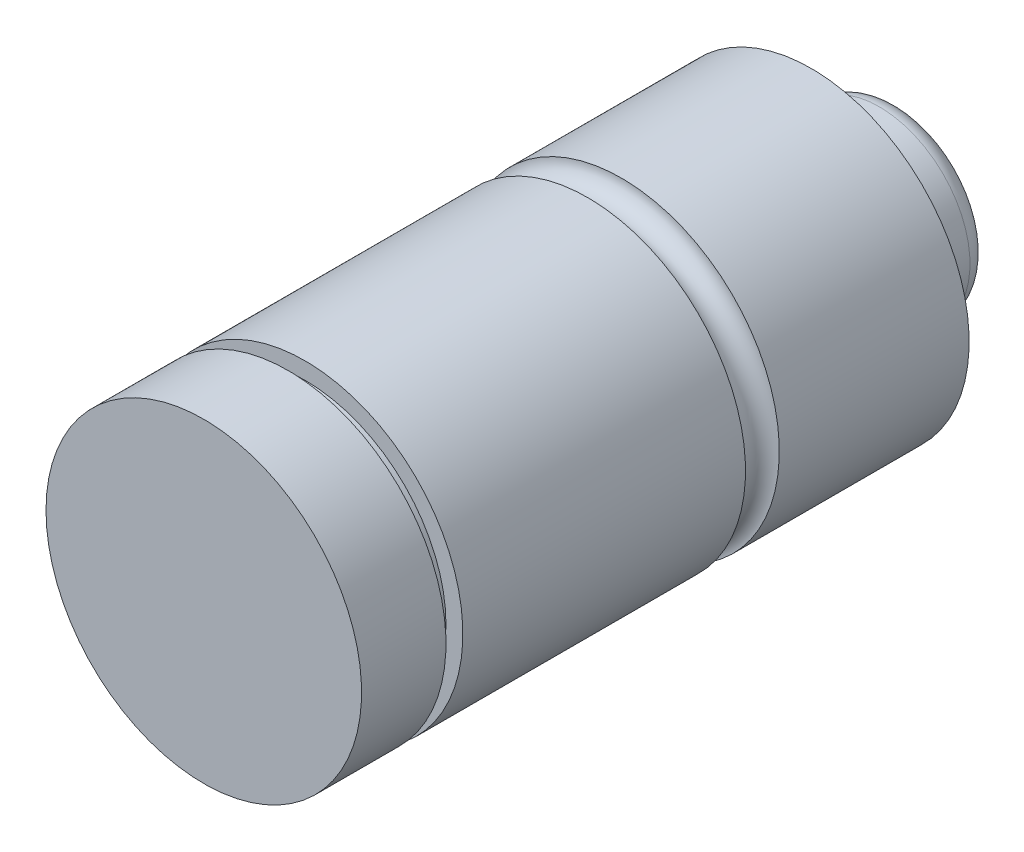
ISO-10303-21;
HEADER;
FILE_DESCRIPTION(('STEP AP214'),'2;1');
FILE_NAME('part.step','',(''),(''),'','','');
FILE_SCHEMA(('AUTOMOTIVE_DESIGN { 1 0 10303 214 1 1 1 1 }'));
ENDSEC;
DATA;
#1=APPLICATION_CONTEXT('core data for automotive mechanical design processes');
#2=APPLICATION_PROTOCOL_DEFINITION('international standard','automotive_design',2000,#1);
#3=PRODUCT_CONTEXT('',#1,'mechanical');
#4=PRODUCT('Part','Part','',(#3));
#5=PRODUCT_RELATED_PRODUCT_CATEGORY('part','',(#4));
#6=PRODUCT_DEFINITION_FORMATION('','',#4);
#7=PRODUCT_DEFINITION_CONTEXT('part definition',#1,'design');
#8=PRODUCT_DEFINITION('design','',#6,#7);
#9=PRODUCT_DEFINITION_SHAPE('','',#8);
#10=(LENGTH_UNIT() NAMED_UNIT(*) SI_UNIT(.MILLI.,.METRE.));
#11=(NAMED_UNIT(*) PLANE_ANGLE_UNIT() SI_UNIT($,.RADIAN.));
#12=(NAMED_UNIT(*) SI_UNIT($,.STERADIAN.) SOLID_ANGLE_UNIT());
#13=UNCERTAINTY_MEASURE_WITH_UNIT(LENGTH_MEASURE(1.E-05),#10,'distance_accuracy_value','');
#14=(GEOMETRIC_REPRESENTATION_CONTEXT(3) GLOBAL_UNCERTAINTY_ASSIGNED_CONTEXT((#13)) GLOBAL_UNIT_ASSIGNED_CONTEXT((#10,
#11,#12)) REPRESENTATION_CONTEXT('',''));
#15=CARTESIAN_POINT('',(0.,0.,0.));
#16=DIRECTION('',(0.,0.,1.));
#17=DIRECTION('',(1.,0.,0.));
#18=AXIS2_PLACEMENT_3D('',#15,#16,#17);
#19=CARTESIAN_POINT('',(0.,0.,-88.0737961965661));
#20=DIRECTION('',(0.,0.,-1.));
#21=DIRECTION('',(-1.,0.,0.));
#22=AXIS2_PLACEMENT_3D('',#19,#20,#21);
#23=CYLINDRICAL_SURFACE('',#22,5.461);
#24=CARTESIAN_POINT('',(0.,0.,-40.6652000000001));
#25=DIRECTION('',(0.,0.,-1.));
#26=DIRECTION('',(-1.,0.,0.));
#27=AXIS2_PLACEMENT_3D('',#24,#25,#26);
#28=CIRCLE('',#27,5.461);
#29=CARTESIAN_POINT('',(-5.461,0.,-40.6652000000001));
#30=VERTEX_POINT('',#29);
#31=EDGE_CURVE('E10',#30,#30,#28,.T.);
#32=ORIENTED_EDGE('',*,*,#31,.F.);
#33=EDGE_LOOP('',(#32));
#34=FACE_BOUND('',#33,.T.);
#35=CARTESIAN_POINT('',(0.,0.,-36.5760000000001));
#36=DIRECTION('',(0.,0.,-1.));
#37=DIRECTION('',(-1.,0.,0.));
#38=AXIS2_PLACEMENT_3D('',#35,#36,#37);
#39=CIRCLE('',#38,5.461);
#40=CARTESIAN_POINT('',(-5.461,0.,-36.5760000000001));
#41=VERTEX_POINT('',#40);
#42=EDGE_CURVE('E94',#41,#41,#39,.T.);
#43=ORIENTED_EDGE('',*,*,#42,.T.);
#44=EDGE_LOOP('',(#43));
#45=FACE_BOUND('',#44,.T.);
#46=ADVANCED_FACE('F45',(#34,#45),#23,.T.);
#47=CARTESIAN_POINT('',(0.,0.,-40.6652000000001));
#48=DIRECTION('',(0.,0.,-1.));
#49=DIRECTION('',(-1.,0.,0.));
#50=AXIS2_PLACEMENT_3D('',#47,#48,#49);
#51=TOROIDAL_SURFACE('',#50,4.2672,1.1938);
#52=CARTESIAN_POINT('',(0.,0.,-41.8590000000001));
#53=DIRECTION('',(0.,0.,-1.));
#54=DIRECTION('',(-1.,0.,0.));
#55=AXIS2_PLACEMENT_3D('',#52,#53,#54);
#56=CIRCLE('',#55,4.2672);
#57=CARTESIAN_POINT('',(-4.2672,0.,-41.8590000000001));
#58=VERTEX_POINT('',#57);
#59=EDGE_CURVE('E52',#58,#58,#56,.T.);
#60=ORIENTED_EDGE('',*,*,#59,.F.);
#61=EDGE_LOOP('',(#60));
#62=FACE_BOUND('',#61,.T.);
#63=ORIENTED_EDGE('',*,*,#31,.T.);
#64=EDGE_LOOP('',(#63));
#65=FACE_BOUND('',#64,.T.);
#66=ADVANCED_FACE('F156',(#62,#65),#51,.T.);
#67=CARTESIAN_POINT('',(-4.26720000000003,0.,-41.8590000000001));
#68=DIRECTION('',(0.,0.,1.));
#69=DIRECTION('',(1.,0.,0.));
#70=AXIS2_PLACEMENT_3D('',#67,#68,#69);
#71=PLANE('',#70);
#72=ORIENTED_EDGE('',*,*,#59,.T.);
#73=EDGE_LOOP('',(#72));
#74=FACE_BOUND('',#73,.T.);
#75=ADVANCED_FACE('F151',(#74),#71,.F.);
#76=CARTESIAN_POINT('',(0.,0.,0.));
#77=DIRECTION('',(0.,0.,-1.));
#78=DIRECTION('',(-1.,0.,0.));
#79=AXIS2_PLACEMENT_3D('',#76,#77,#78);
#80=PLANE('',#79);
#81=CARTESIAN_POINT('',(0.,0.,0.));
#82=DIRECTION('',(0.,0.,-1.));
#83=DIRECTION('',(-1.,0.,0.));
#84=AXIS2_PLACEMENT_3D('',#81,#82,#83);
#85=CIRCLE('',#84,9.4996);
#86=CARTESIAN_POINT('',(-9.4996,0.,0.));
#87=VERTEX_POINT('',#86);
#88=EDGE_CURVE('E58',#87,#87,#85,.T.);
#89=ORIENTED_EDGE('',*,*,#88,.F.);
#90=EDGE_LOOP('',(#89));
#91=FACE_BOUND('',#90,.T.);
#92=ADVANCED_FACE('F146',(#91),#80,.F.);
#93=CARTESIAN_POINT('',(0.,0.,-88.0737961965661));
#94=DIRECTION('',(0.,0.,-1.));
#95=DIRECTION('',(-1.,0.,0.));
#96=AXIS2_PLACEMENT_3D('',#93,#94,#95);
#97=CYLINDRICAL_SURFACE('',#96,9.4996);
#98=CARTESIAN_POINT('',(0.,0.,-5.08));
#99=DIRECTION('',(0.,0.,-1.));
#100=DIRECTION('',(-1.,0.,0.));
#101=AXIS2_PLACEMENT_3D('',#98,#99,#100);
#102=CIRCLE('',#101,9.4996);
#103=CARTESIAN_POINT('',(-9.4996,0.,-5.08));
#104=VERTEX_POINT('',#103);
#105=EDGE_CURVE('E64',#104,#104,#102,.T.);
#106=ORIENTED_EDGE('',*,*,#105,.F.);
#107=EDGE_LOOP('',(#106));
#108=FACE_BOUND('',#107,.T.);
#109=ORIENTED_EDGE('',*,*,#88,.T.);
#110=EDGE_LOOP('',(#109));
#111=FACE_BOUND('',#110,.T.);
#112=ADVANCED_FACE('F140',(#108,#111),#97,.T.);
#113=CARTESIAN_POINT('',(-9.49960000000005,0.,-5.08));
#114=DIRECTION('',(0.,0.,1.));
#115=DIRECTION('',(1.,0.,0.));
#116=AXIS2_PLACEMENT_3D('',#113,#114,#115);
#117=PLANE('',#116);
#118=CARTESIAN_POINT('',(0.,0.,-5.08));
#119=DIRECTION('',(0.,0.,-1.));
#120=DIRECTION('',(-1.,0.,0.));
#121=AXIS2_PLACEMENT_3D('',#118,#119,#120);
#122=CIRCLE('',#121,8.4836);
#123=CARTESIAN_POINT('',(-8.4836,0.,-5.08));
#124=VERTEX_POINT('',#123);
#125=EDGE_CURVE('E70',#124,#124,#122,.T.);
#126=ORIENTED_EDGE('',*,*,#125,.F.);
#127=EDGE_LOOP('',(#126));
#128=FACE_BOUND('',#127,.T.);
#129=ORIENTED_EDGE('',*,*,#105,.T.);
#130=EDGE_LOOP('',(#129));
#131=FACE_BOUND('',#130,.T.);
#132=ADVANCED_FACE('F134',(#128,#131),#117,.F.);
#133=CARTESIAN_POINT('',(0.,0.,-88.0737961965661));
#134=DIRECTION('',(0.,0.,-1.));
#135=DIRECTION('',(-1.,0.,0.));
#136=AXIS2_PLACEMENT_3D('',#133,#134,#135);
#137=CYLINDRICAL_SURFACE('',#136,8.4836);
#138=CARTESIAN_POINT('',(0.,0.,-6.096));
#139=DIRECTION('',(0.,0.,-1.));
#140=DIRECTION('',(-1.,0.,0.));
#141=AXIS2_PLACEMENT_3D('',#138,#139,#140);
#142=CIRCLE('',#141,8.4836);
#143=CARTESIAN_POINT('',(-8.4836,0.,-6.09600000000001));
#144=VERTEX_POINT('',#143);
#145=EDGE_CURVE('E74',#144,#144,#142,.T.);
#146=ORIENTED_EDGE('',*,*,#145,.F.);
#147=EDGE_LOOP('',(#146));
#148=FACE_BOUND('',#147,.T.);
#149=ORIENTED_EDGE('',*,*,#125,.T.);
#150=EDGE_LOOP('',(#149));
#151=FACE_BOUND('',#150,.T.);
#152=ADVANCED_FACE('F128',(#148,#151),#137,.T.);
#153=CARTESIAN_POINT('',(-8.48360000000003,0.,-6.096));
#154=DIRECTION('',(0.,0.,-1.));
#155=DIRECTION('',(-1.,0.,0.));
#156=AXIS2_PLACEMENT_3D('',#153,#154,#155);
#157=PLANE('',#156);
#158=CARTESIAN_POINT('',(0.,0.,-6.096));
#159=DIRECTION('',(0.,0.,-1.));
#160=DIRECTION('',(-1.,0.,0.));
#161=AXIS2_PLACEMENT_3D('',#158,#159,#160);
#162=CIRCLE('',#161,9.4996);
#163=CARTESIAN_POINT('',(-9.4996,0.,-6.09600000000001));
#164=VERTEX_POINT('',#163);
#165=EDGE_CURVE('E78',#164,#164,#162,.T.);
#166=ORIENTED_EDGE('',*,*,#165,.F.);
#167=EDGE_LOOP('',(#166));
#168=FACE_BOUND('',#167,.T.);
#169=ORIENTED_EDGE('',*,*,#145,.T.);
#170=EDGE_LOOP('',(#169));
#171=FACE_BOUND('',#170,.T.);
#172=ADVANCED_FACE('F122',(#168,#171),#157,.F.);
#173=CARTESIAN_POINT('',(0.,0.,-88.0737961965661));
#174=DIRECTION('',(0.,0.,-1.));
#175=DIRECTION('',(-1.,0.,0.));
#176=AXIS2_PLACEMENT_3D('',#173,#174,#175);
#177=CYLINDRICAL_SURFACE('',#176,9.4996);
#178=CARTESIAN_POINT('',(0.,0.,-23.1140000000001));
#179=DIRECTION('',(0.,0.,-1.));
#180=DIRECTION('',(-1.,0.,0.));
#181=AXIS2_PLACEMENT_3D('',#178,#179,#180);
#182=CIRCLE('',#181,9.4996);
#183=CARTESIAN_POINT('',(-9.4996,0.,-23.1140000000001));
#184=VERTEX_POINT('',#183);
#185=EDGE_CURVE('E82',#184,#184,#182,.T.);
#186=ORIENTED_EDGE('',*,*,#185,.F.);
#187=EDGE_LOOP('',(#186));
#188=FACE_BOUND('',#187,.T.);
#189=ORIENTED_EDGE('',*,*,#165,.T.);
#190=EDGE_LOOP('',(#189));
#191=FACE_BOUND('',#190,.T.);
#192=ADVANCED_FACE('F116',(#188,#191),#177,.T.);
#193=CARTESIAN_POINT('',(0.,0.,-24.1300000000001));
#194=DIRECTION('',(0.,0.,-1.));
#195=DIRECTION('',(-1.,0.,0.));
#196=AXIS2_PLACEMENT_3D('',#193,#194,#195);
#197=TOROIDAL_SURFACE('',#196,9.4996,1.016);
#198=CARTESIAN_POINT('',(0.,0.,-25.1460000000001));
#199=DIRECTION('',(0.,0.,-1.));
#200=DIRECTION('',(-1.,0.,0.));
#201=AXIS2_PLACEMENT_3D('',#198,#199,#200);
#202=CIRCLE('',#201,9.4996);
#203=CARTESIAN_POINT('',(-9.4996,0.,-25.1460000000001));
#204=VERTEX_POINT('',#203);
#205=EDGE_CURVE('E86',#204,#204,#202,.T.);
#206=ORIENTED_EDGE('',*,*,#205,.F.);
#207=EDGE_LOOP('',(#206));
#208=FACE_BOUND('',#207,.T.);
#209=ORIENTED_EDGE('',*,*,#185,.T.);
#210=EDGE_LOOP('',(#209));
#211=FACE_BOUND('',#210,.T.);
#212=ADVANCED_FACE('F110',(#208,#211),#197,.F.);
#213=CARTESIAN_POINT('',(0.,0.,-88.0737961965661));
#214=DIRECTION('',(0.,0.,-1.));
#215=DIRECTION('',(-1.,0.,0.));
#216=AXIS2_PLACEMENT_3D('',#213,#214,#215);
#217=CYLINDRICAL_SURFACE('',#216,9.49960000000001);
#218=CARTESIAN_POINT('',(0.,0.,-36.5760000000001));
#219=DIRECTION('',(0.,0.,-1.));
#220=DIRECTION('',(-1.,0.,0.));
#221=AXIS2_PLACEMENT_3D('',#218,#219,#220);
#222=CIRCLE('',#221,9.49960000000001);
#223=CARTESIAN_POINT('',(-9.49960000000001,0.,-36.5760000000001));
#224=VERTEX_POINT('',#223);
#225=EDGE_CURVE('E90',#224,#224,#222,.T.);
#226=ORIENTED_EDGE('',*,*,#225,.F.);
#227=EDGE_LOOP('',(#226));
#228=FACE_BOUND('',#227,.T.);
#229=ORIENTED_EDGE('',*,*,#205,.T.);
#230=EDGE_LOOP('',(#229));
#231=FACE_BOUND('',#230,.T.);
#232=ADVANCED_FACE('F104',(#228,#231),#217,.T.);
#233=CARTESIAN_POINT('',(-5.46100000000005,0.,-36.5760000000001));
#234=DIRECTION('',(0.,0.,1.));
#235=DIRECTION('',(1.,0.,0.));
#236=AXIS2_PLACEMENT_3D('',#233,#234,#235);
#237=PLANE('',#236);
#238=ORIENTED_EDGE('',*,*,#42,.F.);
#239=EDGE_LOOP('',(#238));
#240=FACE_BOUND('',#239,.T.);
#241=ORIENTED_EDGE('',*,*,#225,.T.);
#242=EDGE_LOOP('',(#241));
#243=FACE_BOUND('',#242,.T.);
#244=ADVANCED_FACE('F101',(#240,#243),#237,.F.);
#245=CLOSED_SHELL('',(#46,#66,#75,#92,#112,#132,#152,#172,#192,#212,#232,#244));
#246=MANIFOLD_SOLID_BREP('B2',#245);
#247=ADVANCED_BREP_SHAPE_REPRESENTATION('',(#18,#246),#14);
#248=SHAPE_DEFINITION_REPRESENTATION(#9,#247);
ENDSEC;
END-ISO-10303-21;
